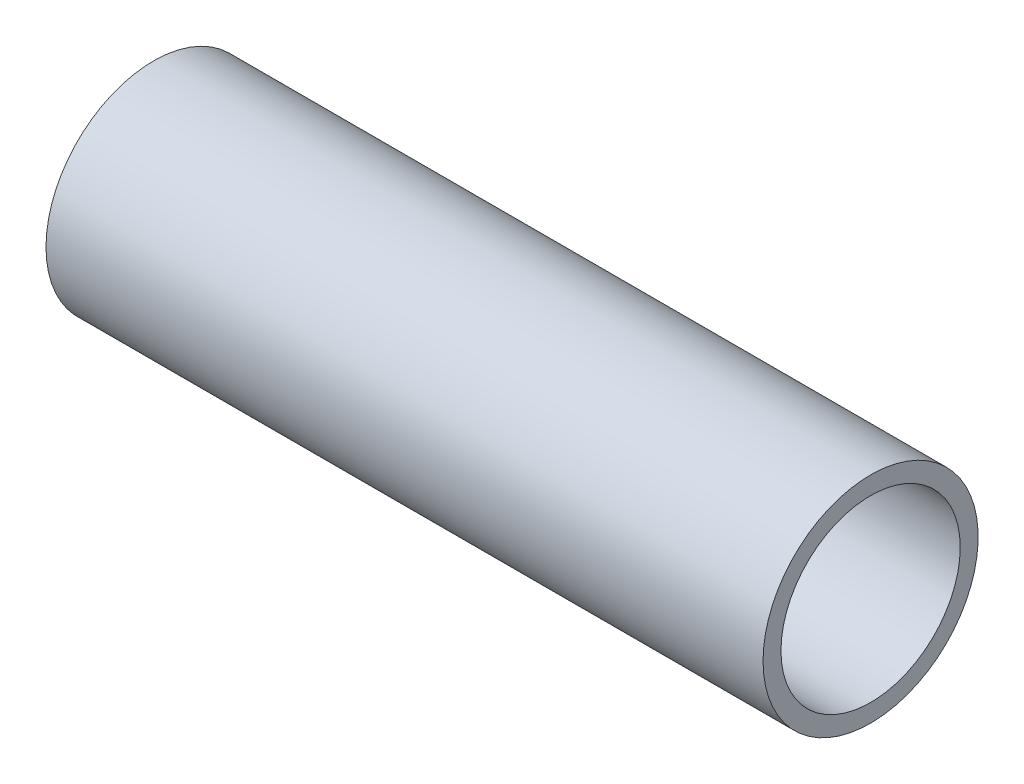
ISO-10303-21;
HEADER;
FILE_DESCRIPTION(('STEP AP214'),'2;1');
FILE_NAME('part.step','',(''),(''),'','','');
FILE_SCHEMA(('AUTOMOTIVE_DESIGN { 1 0 10303 214 1 1 1 1 }'));
ENDSEC;
DATA;
#1=APPLICATION_CONTEXT('core data for automotive mechanical design processes');
#2=APPLICATION_PROTOCOL_DEFINITION('international standard','automotive_design',2000,#1);
#3=PRODUCT_CONTEXT('',#1,'mechanical');
#4=PRODUCT('Part','Part','',(#3));
#5=PRODUCT_RELATED_PRODUCT_CATEGORY('part','',(#4));
#6=PRODUCT_DEFINITION_FORMATION('','',#4);
#7=PRODUCT_DEFINITION_CONTEXT('part definition',#1,'design');
#8=PRODUCT_DEFINITION('design','',#6,#7);
#9=PRODUCT_DEFINITION_SHAPE('','',#8);
#10=(LENGTH_UNIT() NAMED_UNIT(*) SI_UNIT(.MILLI.,.METRE.));
#11=(NAMED_UNIT(*) PLANE_ANGLE_UNIT() SI_UNIT($,.RADIAN.));
#12=(NAMED_UNIT(*) SI_UNIT($,.STERADIAN.) SOLID_ANGLE_UNIT());
#13=UNCERTAINTY_MEASURE_WITH_UNIT(LENGTH_MEASURE(1.E-05),#10,'distance_accuracy_value','');
#14=(GEOMETRIC_REPRESENTATION_CONTEXT(3) GLOBAL_UNCERTAINTY_ASSIGNED_CONTEXT((#13)) GLOBAL_UNIT_ASSIGNED_CONTEXT((#10,
#11,#12)) REPRESENTATION_CONTEXT('',''));
#15=CARTESIAN_POINT('',(0.,0.,0.));
#16=DIRECTION('',(0.,0.,1.));
#17=DIRECTION('',(1.,0.,0.));
#18=AXIS2_PLACEMENT_3D('',#15,#16,#17);
#19=CARTESIAN_POINT('',(0.,30.,0.));
#20=DIRECTION('',(1.,0.,0.));
#21=DIRECTION('',(0.,0.,-1.));
#22=AXIS2_PLACEMENT_3D('',#19,#20,#21);
#23=PLANE('',#22);
#24=CARTESIAN_POINT('',(0.,0.,0.));
#25=DIRECTION('',(-1.,0.,0.));
#26=DIRECTION('',(0.,0.,1.));
#27=AXIS2_PLACEMENT_3D('',#24,#25,#26);
#28=CIRCLE('',#27,25.);
#29=CARTESIAN_POINT('',(0.,0.,25.));
#30=VERTEX_POINT('',#29);
#31=EDGE_CURVE('E10',#30,#30,#28,.T.);
#32=ORIENTED_EDGE('',*,*,#31,.F.);
#33=EDGE_LOOP('',(#32));
#34=FACE_BOUND('',#33,.T.);
#35=CARTESIAN_POINT('',(0.,0.,0.));
#36=DIRECTION('',(-1.,0.,0.));
#37=DIRECTION('',(0.,0.,1.));
#38=AXIS2_PLACEMENT_3D('',#35,#36,#37);
#39=CIRCLE('',#38,30.);
#40=CARTESIAN_POINT('',(0.,0.,30.));
#41=VERTEX_POINT('',#40);
#42=EDGE_CURVE('E49',#41,#41,#39,.T.);
#43=ORIENTED_EDGE('',*,*,#42,.T.);
#44=EDGE_LOOP('',(#43));
#45=FACE_BOUND('',#44,.T.);
#46=ADVANCED_FACE('F35',(#34,#45),#23,.F.);
#47=CARTESIAN_POINT('',(0.,0.,0.));
#48=DIRECTION('',(-1.,0.,0.));
#49=DIRECTION('',(0.,0.,1.));
#50=AXIS2_PLACEMENT_3D('',#47,#48,#49);
#51=CYLINDRICAL_SURFACE('',#50,25.);
#52=CARTESIAN_POINT('',(200.,0.,0.));
#53=DIRECTION('',(-1.,0.,0.));
#54=DIRECTION('',(0.,0.,1.));
#55=AXIS2_PLACEMENT_3D('',#52,#53,#54);
#56=CIRCLE('',#55,25.);
#57=CARTESIAN_POINT('',(200.,0.,25.));
#58=VERTEX_POINT('',#57);
#59=EDGE_CURVE('E41',#58,#58,#56,.T.);
#60=ORIENTED_EDGE('',*,*,#59,.F.);
#61=EDGE_LOOP('',(#60));
#62=FACE_BOUND('',#61,.T.);
#63=ORIENTED_EDGE('',*,*,#31,.T.);
#64=EDGE_LOOP('',(#63));
#65=FACE_BOUND('',#64,.T.);
#66=ADVANCED_FACE('F64',(#62,#65),#51,.F.);
#67=CARTESIAN_POINT('',(200.,30.,0.));
#68=DIRECTION('',(-1.,0.,0.));
#69=DIRECTION('',(0.,0.,1.));
#70=AXIS2_PLACEMENT_3D('',#67,#68,#69);
#71=PLANE('',#70);
#72=CARTESIAN_POINT('',(200.,0.,0.));
#73=DIRECTION('',(-1.,0.,0.));
#74=DIRECTION('',(0.,0.,1.));
#75=AXIS2_PLACEMENT_3D('',#72,#73,#74);
#76=CIRCLE('',#75,30.);
#77=CARTESIAN_POINT('',(200.,0.,30.));
#78=VERTEX_POINT('',#77);
#79=EDGE_CURVE('E45',#78,#78,#76,.T.);
#80=ORIENTED_EDGE('',*,*,#79,.F.);
#81=EDGE_LOOP('',(#80));
#82=FACE_BOUND('',#81,.T.);
#83=ORIENTED_EDGE('',*,*,#59,.T.);
#84=EDGE_LOOP('',(#83));
#85=FACE_BOUND('',#84,.T.);
#86=ADVANCED_FACE('F59',(#82,#85),#71,.F.);
#87=CARTESIAN_POINT('',(0.,0.,0.));
#88=DIRECTION('',(-1.,0.,0.));
#89=DIRECTION('',(0.,0.,1.));
#90=AXIS2_PLACEMENT_3D('',#87,#88,#89);
#91=CYLINDRICAL_SURFACE('',#90,30.);
#92=ORIENTED_EDGE('',*,*,#42,.F.);
#93=EDGE_LOOP('',(#92));
#94=FACE_BOUND('',#93,.T.);
#95=ORIENTED_EDGE('',*,*,#79,.T.);
#96=EDGE_LOOP('',(#95));
#97=FACE_BOUND('',#96,.T.);
#98=ADVANCED_FACE('F56',(#94,#97),#91,.T.);
#99=CLOSED_SHELL('',(#46,#66,#86,#98));
#100=MANIFOLD_SOLID_BREP('B2',#99);
#101=ADVANCED_BREP_SHAPE_REPRESENTATION('',(#18,#100),#14);
#102=SHAPE_DEFINITION_REPRESENTATION(#9,#101);
ENDSEC;
END-ISO-10303-21;
